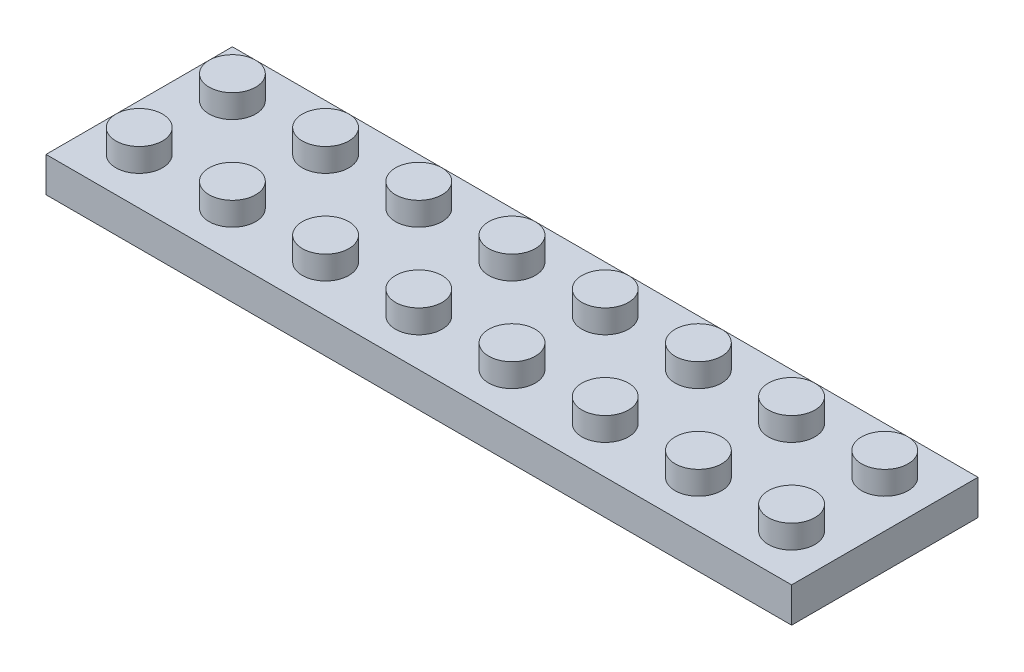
from build123d import *

# Parameters (mm, degrees)
CROQUIS1_W              = 64
CROQUIS1_H              = 16
SALIENTE_EXTRUIR1_DEPTH = 3
CROQUIS2_R              = 2
SALIENTE_EXTRUIR2_DEPTH = 2
VACIADO1_T              = -1
CROQUIS3_R              = 2.8
CROQUIS3_R_2            = 1.8
SALIENTE_EXTRUIR3_DEPTH = 2
MATRIZL1_COUNT          = 7
MATRIZL1_PITCH          = 8


with BuildPart() as part:
    # Croquis1 → Saliente-Extruir1 (new body)
    with BuildSketch(Plane(origin=(0, 0, 0), x_dir=(1, 0, 0), z_dir=(0, 1, 0))):
        Rectangle(CROQUIS1_W, CROQUIS1_H)
    extrude(amount=SALIENTE_EXTRUIR1_DEPTH)

    # Croquis2 → Saliente-Extruir2 (add)
    with BuildSketch(Plane(origin=(0, 3, 0), x_dir=(1, 0, 0), z_dir=(0, 1, 0))):
        with Locations(Location((-28, 4, 0), (0, 0, 270))):
            Circle(CROQUIS2_R)
        with Locations(Location((-20, 4, 0), (0, 0, 270))):
            Circle(CROQUIS2_R)
        with Locations(Location((-12, 4, 0), (0, 0, 270))):
            Circle(CROQUIS2_R)
        with Locations(Location((-4, 4, 0), (0, 0, 270))):
            Circle(CROQUIS2_R)
        with Locations(Location((4, 4, 0), (0, 0, 270))):
            Circle(CROQUIS2_R)
        with Locations(Location((12, 4, 0), (0, 0, 270))):
            Circle(CROQUIS2_R)
        with Locations(Location((20, 4, 0), (0, 0, 270))):
            Circle(CROQUIS2_R)
        with Locations(Location((28, 4, 0), (0, 0, 270))):
            Circle(CROQUIS2_R)
        with Locations(Location((-20, -4, 0), (0, 0, 270))):
            Circle(CROQUIS2_R)
        with Locations(Location((-12, -4, 0), (0, 0, 270))):
            Circle(CROQUIS2_R)
        with Locations(Location((-4, -4, 0), (0, 0, 270))):
            Circle(CROQUIS2_R)
        with Locations(Location((4, -4, 0), (0, 0, 270))):
            Circle(CROQUIS2_R)
        with Locations(Location((12, -4, 0), (0, 0, 270))):
            Circle(CROQUIS2_R)
        with Locations(Location((20, -4, 0), (0, 0, 270))):
            Circle(CROQUIS2_R)
        with Locations(Location((28, -4, 0), (0, 0, 270))):
            Circle(CROQUIS2_R)
        with Locations(Location((-28, -4, 0), (0, 0, 270))):
            Circle(CROQUIS2_R)
    extrude(amount=SALIENTE_EXTRUIR2_DEPTH)

    # Vaciado1
    vaciado1_openings = [part.faces().sort_by_distance(p)[0] for p in [
        (0, 0, 0),
    ]]
    offset(amount=VACIADO1_T, openings=vaciado1_openings, kind=Kind.INTERSECTION)

    # Croquis3 → Saliente-Extruir3 (add)
    with BuildSketch(Plane.XZ.offset(-2)):
        with Locations(Location((-24, 0, 0), (0, 0, 90))):
            Circle(CROQUIS3_R)
        with Locations(Location((-24, 0, 0), (0, 0, 270))):
            Circle(CROQUIS3_R_2, mode=Mode.SUBTRACT)
    saliente_extruir3 = extrude(amount=SALIENTE_EXTRUIR3_DEPTH)

    # MatrizL1: Saliente-Extruir3 ×7
    with Locations(*[(i * MATRIZL1_PITCH, 0, 0) for i in range(1, MATRIZL1_COUNT)]):
        add(saliente_extruir3)


solid = part.part
